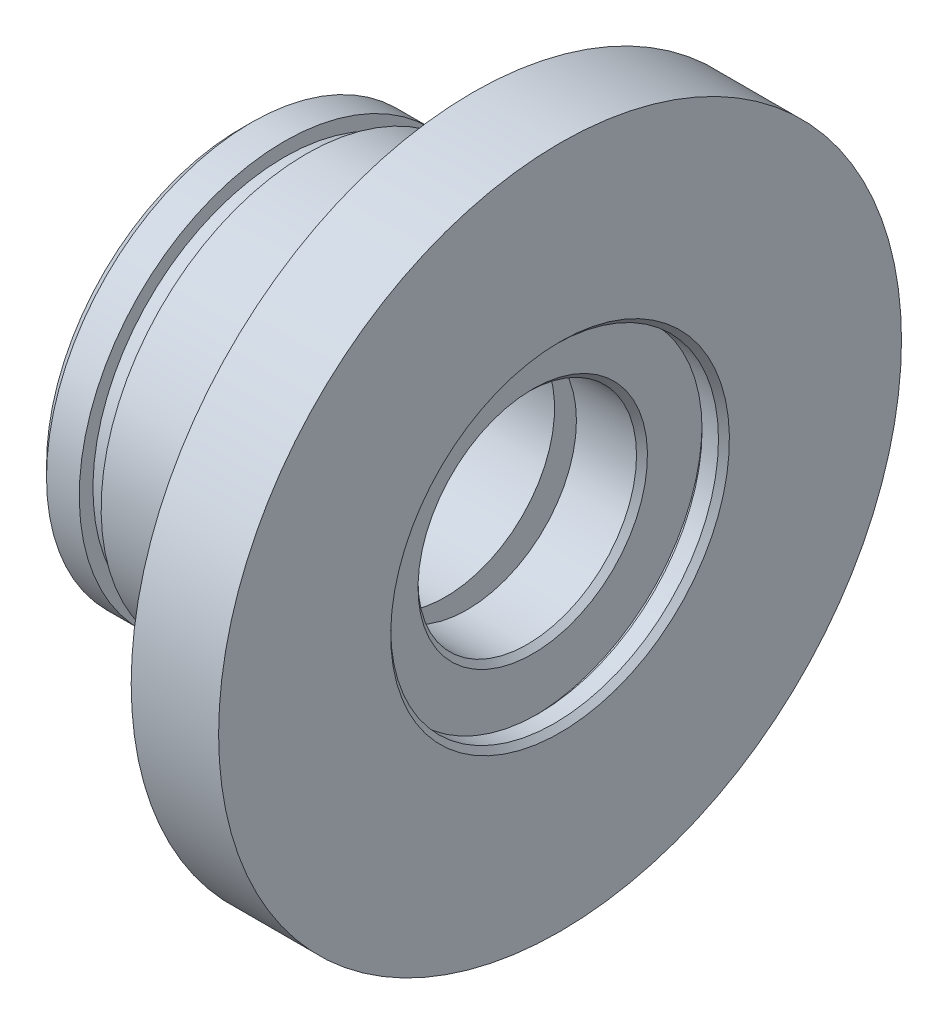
ISO-10303-21;
HEADER;
FILE_DESCRIPTION(('STEP AP214'),'2;1');
FILE_NAME('part.step','',(''),(''),'','','');
FILE_SCHEMA(('AUTOMOTIVE_DESIGN { 1 0 10303 214 1 1 1 1 }'));
ENDSEC;
DATA;
#1=APPLICATION_CONTEXT('core data for automotive mechanical design processes');
#2=APPLICATION_PROTOCOL_DEFINITION('international standard','automotive_design',2000,#1);
#3=PRODUCT_CONTEXT('',#1,'mechanical');
#4=PRODUCT('Part','Part','',(#3));
#5=PRODUCT_RELATED_PRODUCT_CATEGORY('part','',(#4));
#6=PRODUCT_DEFINITION_FORMATION('','',#4);
#7=PRODUCT_DEFINITION_CONTEXT('part definition',#1,'design');
#8=PRODUCT_DEFINITION('design','',#6,#7);
#9=PRODUCT_DEFINITION_SHAPE('','',#8);
#10=(LENGTH_UNIT() NAMED_UNIT(*) SI_UNIT(.MILLI.,.METRE.));
#11=(NAMED_UNIT(*) PLANE_ANGLE_UNIT() SI_UNIT($,.RADIAN.));
#12=(NAMED_UNIT(*) SI_UNIT($,.STERADIAN.) SOLID_ANGLE_UNIT());
#13=UNCERTAINTY_MEASURE_WITH_UNIT(LENGTH_MEASURE(1.E-05),#10,'distance_accuracy_value','');
#14=(GEOMETRIC_REPRESENTATION_CONTEXT(3) GLOBAL_UNCERTAINTY_ASSIGNED_CONTEXT((#13)) GLOBAL_UNIT_ASSIGNED_CONTEXT((#10,
#11,#12)) REPRESENTATION_CONTEXT('',''));
#15=CARTESIAN_POINT('',(0.,0.,0.));
#16=DIRECTION('',(0.,0.,1.));
#17=DIRECTION('',(1.,0.,0.));
#18=AXIS2_PLACEMENT_3D('',#15,#16,#17);
#19=CARTESIAN_POINT('',(0.,0.,0.));
#20=DIRECTION('',(1.,0.,0.));
#21=DIRECTION('',(0.,1.,0.));
#22=AXIS2_PLACEMENT_3D('',#19,#20,#21);
#23=CYLINDRICAL_SURFACE('',#22,75.);
#24=CARTESIAN_POINT('',(-71.1849932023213,0.,0.));
#25=DIRECTION('',(-1.,0.,0.));
#26=DIRECTION('',(0.,-1.,0.));
#27=AXIS2_PLACEMENT_3D('',#24,#25,#26);
#28=CIRCLE('',#27,75.);
#29=CARTESIAN_POINT('',(-71.1849932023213,-75.,0.));
#30=VERTEX_POINT('',#29);
#31=EDGE_CURVE('E114',#30,#30,#28,.F.);
#32=ORIENTED_EDGE('',*,*,#31,.T.);
#33=EDGE_LOOP('',(#32));
#34=FACE_BOUND('',#33,.T.);
#35=CARTESIAN_POINT('',(-59.1849932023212,0.,0.));
#36=DIRECTION('',(1.,0.,0.));
#37=DIRECTION('',(0.,1.,0.));
#38=AXIS2_PLACEMENT_3D('',#35,#36,#37);
#39=CIRCLE('',#38,75.);
#40=CARTESIAN_POINT('',(-59.1849932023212,75.,0.));
#41=VERTEX_POINT('',#40);
#42=EDGE_CURVE('E268',#41,#41,#39,.T.);
#43=ORIENTED_EDGE('',*,*,#42,.F.);
#44=EDGE_LOOP('',(#43));
#45=FACE_BOUND('',#44,.T.);
#46=ADVANCED_FACE('F37',(#34,#45),#23,.T.);
#47=CARTESIAN_POINT('',(-75.1849932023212,75.,0.));
#48=DIRECTION('',(-1.,0.,0.));
#49=DIRECTION('',(0.,-1.,0.));
#50=AXIS2_PLACEMENT_3D('',#47,#48,#49);
#51=PLANE('',#50);
#52=CARTESIAN_POINT('',(-75.1849932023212,0.,0.));
#53=DIRECTION('',(-1.,0.,0.));
#54=DIRECTION('',(0.,-1.,0.));
#55=AXIS2_PLACEMENT_3D('',#52,#53,#54);
#56=CIRCLE('',#55,58.9999999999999);
#57=CARTESIAN_POINT('',(-75.1849932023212,-59.,0.));
#58=VERTEX_POINT('',#57);
#59=EDGE_CURVE('E120',#58,#58,#56,.F.);
#60=ORIENTED_EDGE('',*,*,#59,.T.);
#61=EDGE_LOOP('',(#60));
#62=FACE_BOUND('',#61,.T.);
#63=CARTESIAN_POINT('',(-75.1849932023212,0.,0.));
#64=DIRECTION('',(-1.,0.,0.));
#65=DIRECTION('',(0.,-1.,0.));
#66=AXIS2_PLACEMENT_3D('',#63,#64,#65);
#67=CIRCLE('',#66,71.0000000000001);
#68=CARTESIAN_POINT('',(-75.1849932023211,-71.0000000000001,0.));
#69=VERTEX_POINT('',#68);
#70=EDGE_CURVE('E117',#69,#69,#67,.T.);
#71=ORIENTED_EDGE('',*,*,#70,.T.);
#72=EDGE_LOOP('',(#71));
#73=FACE_BOUND('',#72,.T.);
#74=ADVANCED_FACE('F152',(#62,#73),#51,.T.);
#75=CARTESIAN_POINT('',(0.,0.,0.));
#76=DIRECTION('',(1.,0.,0.));
#77=DIRECTION('',(0.,1.,0.));
#78=AXIS2_PLACEMENT_3D('',#75,#76,#77);
#79=CYLINDRICAL_SURFACE('',#78,55.);
#80=CARTESIAN_POINT('',(-71.1849932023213,0.,0.));
#81=DIRECTION('',(-1.,0.,0.));
#82=DIRECTION('',(0.,-1.,0.));
#83=AXIS2_PLACEMENT_3D('',#80,#81,#82);
#84=CIRCLE('',#83,55.);
#85=CARTESIAN_POINT('',(-71.1849932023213,-55.,0.));
#86=VERTEX_POINT('',#85);
#87=EDGE_CURVE('E123',#86,#86,#84,.T.);
#88=ORIENTED_EDGE('',*,*,#87,.T.);
#89=EDGE_LOOP('',(#88));
#90=FACE_BOUND('',#89,.T.);
#91=CARTESIAN_POINT('',(-50.1849932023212,0.,0.));
#92=DIRECTION('',(1.,0.,0.));
#93=DIRECTION('',(0.,1.,0.));
#94=AXIS2_PLACEMENT_3D('',#91,#92,#93);
#95=CIRCLE('',#94,55.);
#96=CARTESIAN_POINT('',(-50.1849932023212,55.,0.));
#97=VERTEX_POINT('',#96);
#98=EDGE_CURVE('E100',#97,#97,#95,.T.);
#99=ORIENTED_EDGE('',*,*,#98,.T.);
#100=EDGE_LOOP('',(#99));
#101=FACE_BOUND('',#100,.T.);
#102=ADVANCED_FACE('F158',(#90,#101),#79,.F.);
#103=CARTESIAN_POINT('',(-50.1849932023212,55.,0.));
#104=DIRECTION('',(-1.,0.,0.));
#105=DIRECTION('',(0.,-1.,0.));
#106=AXIS2_PLACEMENT_3D('',#103,#104,#105);
#107=PLANE('',#106);
#108=DIRECTION('',(0.,1.,0.));
#109=VECTOR('',#108,1.);
#110=CARTESIAN_POINT('',(-50.1849932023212,27.6726283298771,8.));
#111=LINE('',#110,#109);
#112=CARTESIAN_POINT('',(-50.1849932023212,39.1918358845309,8.));
#113=VERTEX_POINT('',#112);
#114=CARTESIAN_POINT('',(-50.1849932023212,52.,8.));
#115=VERTEX_POINT('',#114);
#116=EDGE_CURVE('E82',#113,#115,#111,.T.);
#117=ORIENTED_EDGE('',*,*,#116,.F.);
#118=CARTESIAN_POINT('',(-50.1849932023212,0.,0.));
#119=DIRECTION('',(1.,0.,0.));
#120=DIRECTION('',(0.,1.,0.));
#121=AXIS2_PLACEMENT_3D('',#118,#119,#120);
#122=CIRCLE('',#121,40.);
#123=CARTESIAN_POINT('',(-50.1849932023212,39.1918358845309,-8.));
#124=VERTEX_POINT('',#123);
#125=EDGE_CURVE('E90',#113,#124,#122,.T.);
#126=ORIENTED_EDGE('',*,*,#125,.T.);
#127=DIRECTION('',(0.,-1.,0.));
#128=VECTOR('',#127,1.);
#129=CARTESIAN_POINT('',(-50.1849932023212,27.6726283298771,-8.));
#130=LINE('',#129,#128);
#131=CARTESIAN_POINT('',(-50.1849932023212,52.,-8.));
#132=VERTEX_POINT('',#131);
#133=EDGE_CURVE('E77',#132,#124,#130,.T.);
#134=ORIENTED_EDGE('',*,*,#133,.F.);
#135=DIRECTION('',(0.,0.,-1.));
#136=VECTOR('',#135,1.);
#137=CARTESIAN_POINT('',(-50.1849932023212,52.,-8.));
#138=LINE('',#137,#136);
#139=EDGE_CURVE('E258',#115,#132,#138,.T.);
#140=ORIENTED_EDGE('',*,*,#139,.F.);
#141=EDGE_LOOP('',(#117,#126,#134,#140));
#142=FACE_BOUND('',#141,.T.);
#143=ORIENTED_EDGE('',*,*,#98,.F.);
#144=EDGE_LOOP('',(#143));
#145=FACE_BOUND('',#144,.T.);
#146=ADVANCED_FACE('F97',(#142,#145),#107,.T.);
#147=CARTESIAN_POINT('',(0.,0.,0.));
#148=DIRECTION('',(1.,0.,0.));
#149=DIRECTION('',(0.,1.,0.));
#150=AXIS2_PLACEMENT_3D('',#147,#148,#149);
#151=CYLINDRICAL_SURFACE('',#150,40.);
#152=DIRECTION('',(1.,0.,0.));
#153=VECTOR('',#152,1.);
#154=CARTESIAN_POINT('',(0.,39.1918358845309,8.));
#155=LINE('',#154,#153);
#156=CARTESIAN_POINT('',(-0.184993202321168,39.1918358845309,8.));
#157=VERTEX_POINT('',#156);
#158=EDGE_CURVE('E94',#113,#157,#155,.T.);
#159=ORIENTED_EDGE('',*,*,#158,.T.);
#160=CARTESIAN_POINT('',(-0.184993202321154,0.,0.));
#161=DIRECTION('',(1.,0.,0.));
#162=DIRECTION('',(0.,1.,0.));
#163=AXIS2_PLACEMENT_3D('',#160,#161,#162);
#164=CIRCLE('',#163,40.);
#165=CARTESIAN_POINT('',(-0.184993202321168,39.1918358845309,-8.));
#166=VERTEX_POINT('',#165);
#167=EDGE_CURVE('E92',#157,#166,#164,.T.);
#168=ORIENTED_EDGE('',*,*,#167,.T.);
#169=DIRECTION('',(1.,0.,0.));
#170=VECTOR('',#169,1.);
#171=CARTESIAN_POINT('',(0.,39.1918358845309,-8.));
#172=LINE('',#171,#170);
#173=EDGE_CURVE('E52',#166,#124,#172,.F.);
#174=ORIENTED_EDGE('',*,*,#173,.T.);
#175=ORIENTED_EDGE('',*,*,#125,.F.);
#176=EDGE_LOOP('',(#159,#168,#174,#175));
#177=FACE_BOUND('',#176,.T.);
#178=ADVANCED_FACE('F89',(#177),#151,.F.);
#179=CARTESIAN_POINT('',(-0.184993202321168,40.,0.));
#180=DIRECTION('',(1.,0.,0.));
#181=DIRECTION('',(0.,1.,0.));
#182=AXIS2_PLACEMENT_3D('',#179,#180,#181);
#183=PLANE('',#182);
#184=DIRECTION('',(0.,1.,0.));
#185=VECTOR('',#184,1.);
#186=CARTESIAN_POINT('',(-0.184993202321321,27.6726283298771,8.));
#187=LINE('',#186,#185);
#188=CARTESIAN_POINT('',(-0.184993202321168,52.,8.));
#189=VERTEX_POINT('',#188);
#190=EDGE_CURVE('E265',#157,#189,#187,.T.);
#191=ORIENTED_EDGE('',*,*,#190,.T.);
#192=DIRECTION('',(0.,0.,-1.));
#193=VECTOR('',#192,1.);
#194=CARTESIAN_POINT('',(-0.184993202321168,52.,-8.));
#195=LINE('',#194,#193);
#196=CARTESIAN_POINT('',(-0.184993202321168,52.,-8.));
#197=VERTEX_POINT('',#196);
#198=EDGE_CURVE('E93',#189,#197,#195,.T.);
#199=ORIENTED_EDGE('',*,*,#198,.T.);
#200=DIRECTION('',(0.,-1.,0.));
#201=VECTOR('',#200,1.);
#202=CARTESIAN_POINT('',(-0.184993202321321,27.6726283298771,-8.));
#203=LINE('',#202,#201);
#204=EDGE_CURVE('E83',#197,#166,#203,.T.);
#205=ORIENTED_EDGE('',*,*,#204,.T.);
#206=ORIENTED_EDGE('',*,*,#167,.F.);
#207=EDGE_LOOP('',(#191,#199,#205,#206));
#208=FACE_BOUND('',#207,.T.);
#209=CARTESIAN_POINT('',(-0.184993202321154,0.,0.));
#210=DIRECTION('',(1.,0.,0.));
#211=DIRECTION('',(0.,1.,0.));
#212=AXIS2_PLACEMENT_3D('',#209,#210,#211);
#213=CIRCLE('',#212,54.);
#214=CARTESIAN_POINT('',(-0.18499320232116,54.,0.));
#215=VERTEX_POINT('',#214);
#216=EDGE_CURVE('E105',#215,#215,#213,.T.);
#217=ORIENTED_EDGE('',*,*,#216,.T.);
#218=EDGE_LOOP('',(#217));
#219=FACE_BOUND('',#218,.T.);
#220=ADVANCED_FACE('F193',(#208,#219),#183,.T.);
#221=CARTESIAN_POINT('',(0.,0.,0.));
#222=DIRECTION('',(1.,0.,0.));
#223=DIRECTION('',(0.,1.,0.));
#224=AXIS2_PLACEMENT_3D('',#221,#222,#223);
#225=CYLINDRICAL_SURFACE('',#224,54.);
#226=CARTESIAN_POINT('',(7.81500679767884,0.,0.));
#227=DIRECTION('',(1.,0.,0.));
#228=DIRECTION('',(0.,1.,0.));
#229=AXIS2_PLACEMENT_3D('',#226,#227,#228);
#230=CIRCLE('',#229,54.);
#231=CARTESIAN_POINT('',(7.81500679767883,54.,0.));
#232=VERTEX_POINT('',#231);
#233=EDGE_CURVE('E298',#232,#232,#230,.T.);
#234=ORIENTED_EDGE('',*,*,#233,.T.);
#235=EDGE_LOOP('',(#234));
#236=FACE_BOUND('',#235,.T.);
#237=ORIENTED_EDGE('',*,*,#216,.F.);
#238=EDGE_LOOP('',(#237));
#239=FACE_BOUND('',#238,.T.);
#240=ADVANCED_FACE('F198',(#236,#239),#225,.F.);
#241=CARTESIAN_POINT('',(7.81500679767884,54.,0.));
#242=DIRECTION('',(-1.,0.,0.));
#243=DIRECTION('',(0.,-1.,0.));
#244=AXIS2_PLACEMENT_3D('',#241,#242,#243);
#245=PLANE('',#244);
#246=CARTESIAN_POINT('',(7.81500679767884,0.,0.));
#247=DIRECTION('',(1.,0.,0.));
#248=DIRECTION('',(0.,1.,0.));
#249=AXIS2_PLACEMENT_3D('',#246,#247,#248);
#250=CIRCLE('',#249,40.);
#251=CARTESIAN_POINT('',(7.81500679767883,40.,0.));
#252=VERTEX_POINT('',#251);
#253=EDGE_CURVE('E295',#252,#252,#250,.T.);
#254=ORIENTED_EDGE('',*,*,#253,.T.);
#255=EDGE_LOOP('',(#254));
#256=FACE_BOUND('',#255,.T.);
#257=ORIENTED_EDGE('',*,*,#233,.F.);
#258=EDGE_LOOP('',(#257));
#259=FACE_BOUND('',#258,.T.);
#260=ADVANCED_FACE('F202',(#256,#259),#245,.T.);
#261=CARTESIAN_POINT('',(0.,0.,0.));
#262=DIRECTION('',(1.,0.,0.));
#263=DIRECTION('',(0.,1.,0.));
#264=AXIS2_PLACEMENT_3D('',#261,#262,#263);
#265=CYLINDRICAL_SURFACE('',#264,40.);
#266=CARTESIAN_POINT('',(29.8150067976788,0.,0.));
#267=DIRECTION('',(1.,0.,0.));
#268=DIRECTION('',(0.,1.,0.));
#269=AXIS2_PLACEMENT_3D('',#266,#267,#268);
#270=CIRCLE('',#269,40.);
#271=CARTESIAN_POINT('',(29.8150067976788,40.,0.));
#272=VERTEX_POINT('',#271);
#273=EDGE_CURVE('E126',#272,#272,#270,.T.);
#274=ORIENTED_EDGE('',*,*,#273,.T.);
#275=EDGE_LOOP('',(#274));
#276=FACE_BOUND('',#275,.T.);
#277=ORIENTED_EDGE('',*,*,#253,.F.);
#278=EDGE_LOOP('',(#277));
#279=FACE_BOUND('',#278,.T.);
#280=ADVANCED_FACE('F206',(#276,#279),#265,.F.);
#281=CARTESIAN_POINT('',(31.8150067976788,40.,0.));
#282=DIRECTION('',(1.,0.,0.));
#283=DIRECTION('',(0.,1.,0.));
#284=AXIS2_PLACEMENT_3D('',#281,#282,#283);
#285=PLANE('',#284);
#286=CARTESIAN_POINT('',(31.8150067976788,0.,0.));
#287=DIRECTION('',(1.,0.,0.));
#288=DIRECTION('',(0.,1.,0.));
#289=AXIS2_PLACEMENT_3D('',#286,#287,#288);
#290=CIRCLE('',#289,42.);
#291=CARTESIAN_POINT('',(31.8150067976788,42.,0.));
#292=VERTEX_POINT('',#291);
#293=EDGE_CURVE('E129',#292,#292,#290,.F.);
#294=ORIENTED_EDGE('',*,*,#293,.T.);
#295=EDGE_LOOP('',(#294));
#296=FACE_BOUND('',#295,.T.);
#297=CARTESIAN_POINT('',(31.8150067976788,0.,0.));
#298=DIRECTION('',(1.,0.,0.));
#299=DIRECTION('',(0.,1.,0.));
#300=AXIS2_PLACEMENT_3D('',#297,#298,#299);
#301=CIRCLE('',#300,62.);
#302=CARTESIAN_POINT('',(31.8150067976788,62.,0.));
#303=VERTEX_POINT('',#302);
#304=EDGE_CURVE('E292',#303,#303,#301,.T.);
#305=ORIENTED_EDGE('',*,*,#304,.T.);
#306=EDGE_LOOP('',(#305));
#307=FACE_BOUND('',#306,.T.);
#308=ADVANCED_FACE('F210',(#296,#307),#285,.T.);
#309=CARTESIAN_POINT('',(0.,0.,0.));
#310=DIRECTION('',(1.,0.,0.));
#311=DIRECTION('',(0.,1.,0.));
#312=AXIS2_PLACEMENT_3D('',#309,#310,#311);
#313=CYLINDRICAL_SURFACE('',#312,62.);
#314=CARTESIAN_POINT('',(33.8150067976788,0.,0.));
#315=DIRECTION('',(1.,0.,0.));
#316=DIRECTION('',(0.,1.,0.));
#317=AXIS2_PLACEMENT_3D('',#314,#315,#316);
#318=CIRCLE('',#317,62.);
#319=CARTESIAN_POINT('',(33.8150067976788,62.,0.));
#320=VERTEX_POINT('',#319);
#321=EDGE_CURVE('E289',#320,#320,#318,.T.);
#322=ORIENTED_EDGE('',*,*,#321,.T.);
#323=EDGE_LOOP('',(#322));
#324=FACE_BOUND('',#323,.T.);
#325=ORIENTED_EDGE('',*,*,#304,.F.);
#326=EDGE_LOOP('',(#325));
#327=FACE_BOUND('',#326,.T.);
#328=ADVANCED_FACE('F214',(#324,#327),#313,.F.);
#329=CARTESIAN_POINT('',(33.8150067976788,62.,0.));
#330=DIRECTION('',(-1.,0.,0.));
#331=DIRECTION('',(0.,-1.,0.));
#332=AXIS2_PLACEMENT_3D('',#329,#330,#331);
#333=PLANE('',#332);
#334=CARTESIAN_POINT('',(33.8150067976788,0.,0.));
#335=DIRECTION('',(1.,0.,0.));
#336=DIRECTION('',(0.,1.,0.));
#337=AXIS2_PLACEMENT_3D('',#334,#335,#336);
#338=CIRCLE('',#337,60.);
#339=CARTESIAN_POINT('',(33.8150067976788,60.,0.));
#340=VERTEX_POINT('',#339);
#341=EDGE_CURVE('E286',#340,#340,#338,.T.);
#342=ORIENTED_EDGE('',*,*,#341,.T.);
#343=EDGE_LOOP('',(#342));
#344=FACE_BOUND('',#343,.T.);
#345=ORIENTED_EDGE('',*,*,#321,.F.);
#346=EDGE_LOOP('',(#345));
#347=FACE_BOUND('',#346,.T.);
#348=ADVANCED_FACE('F218',(#344,#347),#333,.T.);
#349=CARTESIAN_POINT('',(0.,0.,0.));
#350=DIRECTION('',(1.,0.,0.));
#351=DIRECTION('',(0.,1.,0.));
#352=AXIS2_PLACEMENT_3D('',#349,#350,#351);
#353=CYLINDRICAL_SURFACE('',#352,60.);
#354=CARTESIAN_POINT('',(39.8150067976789,0.,0.));
#355=DIRECTION('',(1.,0.,0.));
#356=DIRECTION('',(0.,1.,0.));
#357=AXIS2_PLACEMENT_3D('',#354,#355,#356);
#358=CIRCLE('',#357,60.);
#359=CARTESIAN_POINT('',(39.8150067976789,60.,0.));
#360=VERTEX_POINT('',#359);
#361=EDGE_CURVE('E45',#360,#360,#358,.T.);
#362=ORIENTED_EDGE('',*,*,#361,.T.);
#363=EDGE_LOOP('',(#362));
#364=FACE_BOUND('',#363,.T.);
#365=ORIENTED_EDGE('',*,*,#341,.F.);
#366=EDGE_LOOP('',(#365));
#367=FACE_BOUND('',#366,.T.);
#368=ADVANCED_FACE('F134',(#364,#367),#353,.F.);
#369=CARTESIAN_POINT('',(41.8150067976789,60.,0.));
#370=DIRECTION('',(1.,0.,0.));
#371=DIRECTION('',(0.,1.,0.));
#372=AXIS2_PLACEMENT_3D('',#369,#370,#371);
#373=PLANE('',#372);
#374=CARTESIAN_POINT('',(41.8150067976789,0.,0.));
#375=DIRECTION('',(1.,0.,0.));
#376=DIRECTION('',(0.,1.,0.));
#377=AXIS2_PLACEMENT_3D('',#374,#375,#376);
#378=CIRCLE('',#377,62.);
#379=CARTESIAN_POINT('',(41.8150067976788,62.,0.));
#380=VERTEX_POINT('',#379);
#381=EDGE_CURVE('E11',#380,#380,#378,.F.);
#382=ORIENTED_EDGE('',*,*,#381,.T.);
#383=EDGE_LOOP('',(#382));
#384=FACE_BOUND('',#383,.T.);
#385=CARTESIAN_POINT('',(41.8150067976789,0.,0.));
#386=DIRECTION('',(1.,0.,0.));
#387=DIRECTION('',(0.,1.,0.));
#388=AXIS2_PLACEMENT_3D('',#385,#386,#387);
#389=CIRCLE('',#388,125.);
#390=CARTESIAN_POINT('',(41.8150067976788,125.,0.));
#391=VERTEX_POINT('',#390);
#392=EDGE_CURVE('E283',#391,#391,#389,.T.);
#393=ORIENTED_EDGE('',*,*,#392,.T.);
#394=EDGE_LOOP('',(#393));
#395=FACE_BOUND('',#394,.T.);
#396=ADVANCED_FACE('F225',(#384,#395),#373,.T.);
#397=CARTESIAN_POINT('',(0.,0.,0.));
#398=DIRECTION('',(1.,0.,0.));
#399=DIRECTION('',(0.,1.,0.));
#400=AXIS2_PLACEMENT_3D('',#397,#398,#399);
#401=CYLINDRICAL_SURFACE('',#400,125.);
#402=CARTESIAN_POINT('',(9.81500679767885,0.,0.));
#403=DIRECTION('',(1.,0.,0.));
#404=DIRECTION('',(0.,1.,0.));
#405=AXIS2_PLACEMENT_3D('',#402,#403,#404);
#406=CIRCLE('',#405,125.);
#407=CARTESIAN_POINT('',(9.81500679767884,125.,0.));
#408=VERTEX_POINT('',#407);
#409=EDGE_CURVE('E280',#408,#408,#406,.T.);
#410=ORIENTED_EDGE('',*,*,#409,.T.);
#411=EDGE_LOOP('',(#410));
#412=FACE_BOUND('',#411,.T.);
#413=ORIENTED_EDGE('',*,*,#392,.F.);
#414=EDGE_LOOP('',(#413));
#415=FACE_BOUND('',#414,.T.);
#416=ADVANCED_FACE('F228',(#412,#415),#401,.T.);
#417=CARTESIAN_POINT('',(9.81500679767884,125.,0.));
#418=DIRECTION('',(-1.,0.,0.));
#419=DIRECTION('',(0.,-1.,0.));
#420=AXIS2_PLACEMENT_3D('',#417,#418,#419);
#421=PLANE('',#420);
#422=CARTESIAN_POINT('',(9.81500679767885,0.,0.));
#423=DIRECTION('',(-1.,0.,0.));
#424=DIRECTION('',(0.,-1.,0.));
#425=AXIS2_PLACEMENT_3D('',#422,#423,#424);
#426=CIRCLE('',#425,85.);
#427=CARTESIAN_POINT('',(9.81500679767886,-85.,0.));
#428=VERTEX_POINT('',#427);
#429=EDGE_CURVE('E103',#428,#428,#426,.F.);
#430=ORIENTED_EDGE('',*,*,#429,.T.);
#431=EDGE_LOOP('',(#430));
#432=FACE_BOUND('',#431,.T.);
#433=ORIENTED_EDGE('',*,*,#409,.F.);
#434=EDGE_LOOP('',(#433));
#435=FACE_BOUND('',#434,.T.);
#436=ADVANCED_FACE('F232',(#432,#435),#421,.T.);
#437=CARTESIAN_POINT('',(0.,0.,0.));
#438=DIRECTION('',(1.,0.,0.));
#439=DIRECTION('',(0.,1.,0.));
#440=AXIS2_PLACEMENT_3D('',#437,#438,#439);
#441=CYLINDRICAL_SURFACE('',#440,75.);
#442=CARTESIAN_POINT('',(-0.184993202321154,0.,0.));
#443=DIRECTION('',(-1.,0.,0.));
#444=DIRECTION('',(0.,-1.,0.));
#445=AXIS2_PLACEMENT_3D('',#442,#443,#444);
#446=CIRCLE('',#445,75.);
#447=CARTESIAN_POINT('',(-0.184993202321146,-75.,0.));
#448=VERTEX_POINT('',#447);
#449=EDGE_CURVE('E111',#448,#448,#446,.T.);
#450=ORIENTED_EDGE('',*,*,#449,.T.);
#451=EDGE_LOOP('',(#450));
#452=FACE_BOUND('',#451,.T.);
#453=CARTESIAN_POINT('',(-51.1849932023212,0.,0.));
#454=DIRECTION('',(1.,0.,0.));
#455=DIRECTION('',(0.,1.,0.));
#456=AXIS2_PLACEMENT_3D('',#453,#454,#455);
#457=CIRCLE('',#456,75.);
#458=CARTESIAN_POINT('',(-51.1849932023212,75.,0.));
#459=VERTEX_POINT('',#458);
#460=EDGE_CURVE('E277',#459,#459,#457,.T.);
#461=ORIENTED_EDGE('',*,*,#460,.T.);
#462=EDGE_LOOP('',(#461));
#463=FACE_BOUND('',#462,.T.);
#464=ADVANCED_FACE('F236',(#452,#463),#441,.T.);
#465=CARTESIAN_POINT('',(-51.1849932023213,75.,0.));
#466=DIRECTION('',(-1.,0.,0.));
#467=DIRECTION('',(0.,-1.,0.));
#468=AXIS2_PLACEMENT_3D('',#465,#466,#467);
#469=PLANE('',#468);
#470=CARTESIAN_POINT('',(-51.1849932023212,0.,0.));
#471=DIRECTION('',(1.,0.,0.));
#472=DIRECTION('',(0.,1.,0.));
#473=AXIS2_PLACEMENT_3D('',#470,#471,#472);
#474=CIRCLE('',#473,70.);
#475=CARTESIAN_POINT('',(-51.1849932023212,70.,0.));
#476=VERTEX_POINT('',#475);
#477=EDGE_CURVE('E274',#476,#476,#474,.T.);
#478=ORIENTED_EDGE('',*,*,#477,.T.);
#479=EDGE_LOOP('',(#478));
#480=FACE_BOUND('',#479,.T.);
#481=ORIENTED_EDGE('',*,*,#460,.F.);
#482=EDGE_LOOP('',(#481));
#483=FACE_BOUND('',#482,.T.);
#484=ADVANCED_FACE('F240',(#480,#483),#469,.T.);
#485=CARTESIAN_POINT('',(0.,0.,0.));
#486=DIRECTION('',(1.,0.,0.));
#487=DIRECTION('',(0.,1.,0.));
#488=AXIS2_PLACEMENT_3D('',#485,#486,#487);
#489=CYLINDRICAL_SURFACE('',#488,70.);
#490=CARTESIAN_POINT('',(-59.1849932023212,0.,0.));
#491=DIRECTION('',(1.,0.,0.));
#492=DIRECTION('',(0.,1.,0.));
#493=AXIS2_PLACEMENT_3D('',#490,#491,#492);
#494=CIRCLE('',#493,70.);
#495=CARTESIAN_POINT('',(-59.1849932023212,70.,0.));
#496=VERTEX_POINT('',#495);
#497=EDGE_CURVE('E271',#496,#496,#494,.T.);
#498=ORIENTED_EDGE('',*,*,#497,.T.);
#499=EDGE_LOOP('',(#498));
#500=FACE_BOUND('',#499,.T.);
#501=ORIENTED_EDGE('',*,*,#477,.F.);
#502=EDGE_LOOP('',(#501));
#503=FACE_BOUND('',#502,.T.);
#504=ADVANCED_FACE('F244',(#500,#503),#489,.T.);
#505=CARTESIAN_POINT('',(-59.1849932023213,75.,0.));
#506=DIRECTION('',(1.,0.,0.));
#507=DIRECTION('',(0.,1.,0.));
#508=AXIS2_PLACEMENT_3D('',#505,#506,#507);
#509=PLANE('',#508);
#510=ORIENTED_EDGE('',*,*,#42,.T.);
#511=EDGE_LOOP('',(#510));
#512=FACE_BOUND('',#511,.T.);
#513=ORIENTED_EDGE('',*,*,#497,.F.);
#514=EDGE_LOOP('',(#513));
#515=FACE_BOUND('',#514,.T.);
#516=ADVANCED_FACE('F168',(#512,#515),#509,.T.);
#517=CARTESIAN_POINT('',(-0.184993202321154,0.,0.));
#518=DIRECTION('',(-1.,0.,0.));
#519=DIRECTION('',(0.,-1.,0.));
#520=AXIS2_PLACEMENT_3D('',#517,#518,#519);
#521=TOROIDAL_SURFACE('',#520,85.,10.);
#522=ORIENTED_EDGE('',*,*,#449,.F.);
#523=EDGE_LOOP('',(#522));
#524=FACE_BOUND('',#523,.T.);
#525=ORIENTED_EDGE('',*,*,#429,.F.);
#526=EDGE_LOOP('',(#525));
#527=FACE_BOUND('',#526,.T.);
#528=ADVANCED_FACE('F164',(#524,#527),#521,.F.);
#529=CARTESIAN_POINT('',(-71.1849932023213,0.,0.));
#530=DIRECTION('',(1.,0.,0.));
#531=DIRECTION('',(0.,1.,0.));
#532=AXIS2_PLACEMENT_3D('',#529,#530,#531);
#533=CONICAL_SURFACE('',#532,75.,0.785398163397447);
#534=ORIENTED_EDGE('',*,*,#70,.F.);
#535=EDGE_LOOP('',(#534));
#536=FACE_BOUND('',#535,.T.);
#537=ORIENTED_EDGE('',*,*,#31,.F.);
#538=EDGE_LOOP('',(#537));
#539=FACE_BOUND('',#538,.T.);
#540=ADVANCED_FACE('F167',(#536,#539),#533,.T.);
#541=CARTESIAN_POINT('',(-75.1849932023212,0.,0.));
#542=DIRECTION('',(-1.,0.,0.));
#543=DIRECTION('',(0.,-1.,0.));
#544=AXIS2_PLACEMENT_3D('',#541,#542,#543);
#545=CONICAL_SURFACE('',#544,58.9999999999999,0.785398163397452);
#546=ORIENTED_EDGE('',*,*,#87,.F.);
#547=EDGE_LOOP('',(#546));
#548=FACE_BOUND('',#547,.T.);
#549=ORIENTED_EDGE('',*,*,#59,.F.);
#550=EDGE_LOOP('',(#549));
#551=FACE_BOUND('',#550,.T.);
#552=ADVANCED_FACE('F148',(#548,#551),#545,.F.);
#553=CARTESIAN_POINT('',(29.8150067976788,0.,0.));
#554=DIRECTION('',(1.,0.,0.));
#555=DIRECTION('',(0.,1.,0.));
#556=AXIS2_PLACEMENT_3D('',#553,#554,#555);
#557=CONICAL_SURFACE('',#556,40.,0.785398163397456);
#558=ORIENTED_EDGE('',*,*,#293,.F.);
#559=EDGE_LOOP('',(#558));
#560=FACE_BOUND('',#559,.T.);
#561=ORIENTED_EDGE('',*,*,#273,.F.);
#562=EDGE_LOOP('',(#561));
#563=FACE_BOUND('',#562,.T.);
#564=ADVANCED_FACE('F139',(#560,#563),#557,.F.);
#565=CARTESIAN_POINT('',(39.8150067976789,0.,0.));
#566=DIRECTION('',(1.,0.,0.));
#567=DIRECTION('',(0.,1.,0.));
#568=AXIS2_PLACEMENT_3D('',#565,#566,#567);
#569=CONICAL_SURFACE('',#568,60.,0.785398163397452);
#570=ORIENTED_EDGE('',*,*,#381,.F.);
#571=EDGE_LOOP('',(#570));
#572=FACE_BOUND('',#571,.T.);
#573=ORIENTED_EDGE('',*,*,#361,.F.);
#574=EDGE_LOOP('',(#573));
#575=FACE_BOUND('',#574,.T.);
#576=ADVANCED_FACE('F39',(#572,#575),#569,.F.);
#577=CARTESIAN_POINT('',(41.8160067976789,27.6726283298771,8.));
#578=DIRECTION('',(0.,0.,1.));
#579=DIRECTION('',(1.,0.,0.));
#580=AXIS2_PLACEMENT_3D('',#577,#578,#579);
#581=PLANE('',#580);
#582=ORIENTED_EDGE('',*,*,#116,.T.);
#583=DIRECTION('',(-1.,0.,0.));
#584=VECTOR('',#583,1.);
#585=CARTESIAN_POINT('',(41.8160067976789,52.,8.));
#586=LINE('',#585,#584);
#587=EDGE_CURVE('E257',#189,#115,#586,.T.);
#588=ORIENTED_EDGE('',*,*,#587,.F.);
#589=ORIENTED_EDGE('',*,*,#190,.F.);
#590=ORIENTED_EDGE('',*,*,#158,.F.);
#591=EDGE_LOOP('',(#582,#588,#589,#590));
#592=FACE_BOUND('',#591,.T.);
#593=ADVANCED_FACE('F138',(#592),#581,.F.);
#594=CARTESIAN_POINT('',(41.8160067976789,52.,-8.));
#595=DIRECTION('',(0.,1.,0.));
#596=DIRECTION('',(-1.,0.,0.));
#597=AXIS2_PLACEMENT_3D('',#594,#595,#596);
#598=PLANE('',#597);
#599=ORIENTED_EDGE('',*,*,#587,.T.);
#600=ORIENTED_EDGE('',*,*,#139,.T.);
#601=DIRECTION('',(-1.,0.,0.));
#602=VECTOR('',#601,1.);
#603=CARTESIAN_POINT('',(41.8160067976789,52.,-8.));
#604=LINE('',#603,#602);
#605=EDGE_CURVE('E60',#197,#132,#604,.T.);
#606=ORIENTED_EDGE('',*,*,#605,.F.);
#607=ORIENTED_EDGE('',*,*,#198,.F.);
#608=EDGE_LOOP('',(#599,#600,#606,#607));
#609=FACE_BOUND('',#608,.T.);
#610=ADVANCED_FACE('F145',(#609),#598,.F.);
#611=CARTESIAN_POINT('',(41.8160067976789,27.6726283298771,-8.));
#612=DIRECTION('',(0.,0.,-1.));
#613=DIRECTION('',(-1.,0.,0.));
#614=AXIS2_PLACEMENT_3D('',#611,#612,#613);
#615=PLANE('',#614);
#616=ORIENTED_EDGE('',*,*,#204,.F.);
#617=ORIENTED_EDGE('',*,*,#605,.T.);
#618=ORIENTED_EDGE('',*,*,#133,.T.);
#619=ORIENTED_EDGE('',*,*,#173,.F.);
#620=EDGE_LOOP('',(#616,#617,#618,#619));
#621=FACE_BOUND('',#620,.T.);
#622=ADVANCED_FACE('F78',(#621),#615,.F.);
#623=CLOSED_SHELL('',(#46,#74,#102,#146,#178,#220,#240,#260,#280,#308,#328,#348,#368,#396,#416,
#436,#464,#484,#504,#516,#528,#540,#552,#564,#576,#593,#610,#622));
#624=MANIFOLD_SOLID_BREP('B2',#623);
#625=ADVANCED_BREP_SHAPE_REPRESENTATION('',(#18,#624),#14);
#626=SHAPE_DEFINITION_REPRESENTATION(#9,#625);
ENDSEC;
END-ISO-10303-21;
